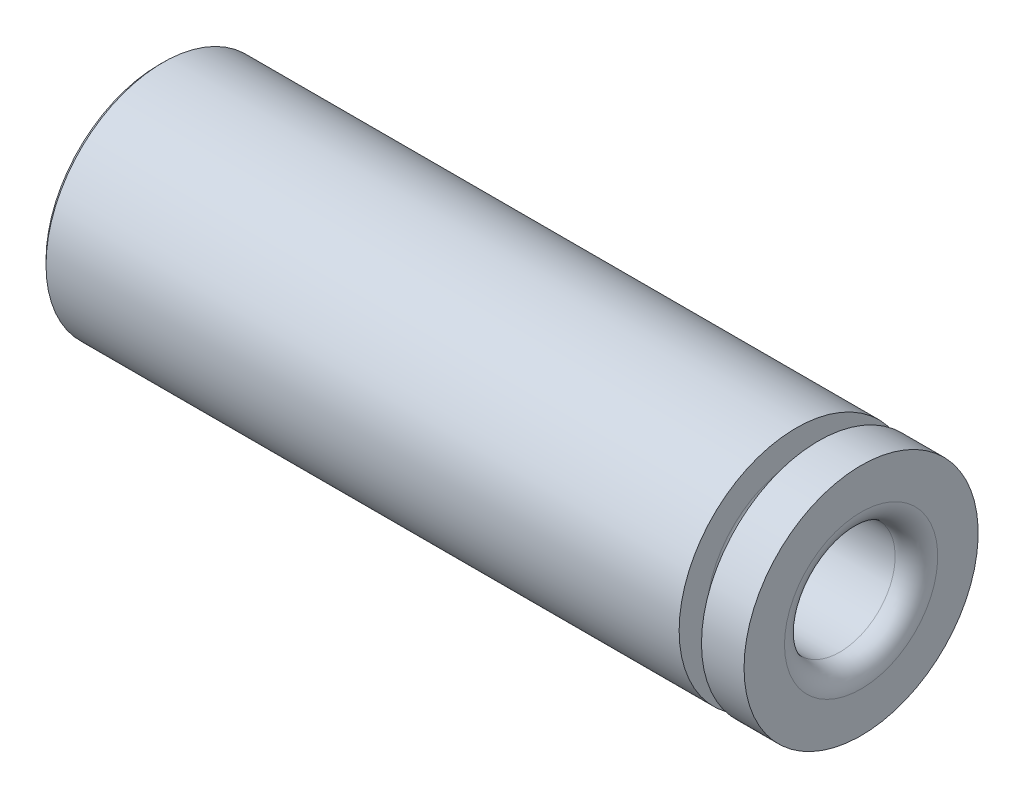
ISO-10303-21;
HEADER;
FILE_DESCRIPTION(('STEP AP214'),'2;1');
FILE_NAME('part.step','',(''),(''),'','','');
FILE_SCHEMA(('AUTOMOTIVE_DESIGN { 1 0 10303 214 1 1 1 1 }'));
ENDSEC;
DATA;
#1=APPLICATION_CONTEXT('core data for automotive mechanical design processes');
#2=APPLICATION_PROTOCOL_DEFINITION('international standard','automotive_design',2000,#1);
#3=PRODUCT_CONTEXT('',#1,'mechanical');
#4=PRODUCT('Part','Part','',(#3));
#5=PRODUCT_RELATED_PRODUCT_CATEGORY('part','',(#4));
#6=PRODUCT_DEFINITION_FORMATION('','',#4);
#7=PRODUCT_DEFINITION_CONTEXT('part definition',#1,'design');
#8=PRODUCT_DEFINITION('design','',#6,#7);
#9=PRODUCT_DEFINITION_SHAPE('','',#8);
#10=(LENGTH_UNIT() NAMED_UNIT(*) SI_UNIT(.MILLI.,.METRE.));
#11=(NAMED_UNIT(*) PLANE_ANGLE_UNIT() SI_UNIT($,.RADIAN.));
#12=(NAMED_UNIT(*) SI_UNIT($,.STERADIAN.) SOLID_ANGLE_UNIT());
#13=UNCERTAINTY_MEASURE_WITH_UNIT(LENGTH_MEASURE(1.E-05),#10,'distance_accuracy_value','');
#14=(GEOMETRIC_REPRESENTATION_CONTEXT(3) GLOBAL_UNCERTAINTY_ASSIGNED_CONTEXT((#13)) GLOBAL_UNIT_ASSIGNED_CONTEXT((#10,
#11,#12)) REPRESENTATION_CONTEXT('',''));
#15=CARTESIAN_POINT('',(0.,0.,0.));
#16=DIRECTION('',(0.,0.,1.));
#17=DIRECTION('',(1.,0.,0.));
#18=AXIS2_PLACEMENT_3D('',#15,#16,#17);
#19=CARTESIAN_POINT('',(0.,0.,0.));
#20=DIRECTION('',(-1.,0.,0.));
#21=DIRECTION('',(0.,0.,1.));
#22=AXIS2_PLACEMENT_3D('',#19,#20,#21);
#23=CYLINDRICAL_SURFACE('',#22,5.5);
#24=CARTESIAN_POINT('',(0.199999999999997,0.,0.));
#25=DIRECTION('',(1.,0.,0.));
#26=DIRECTION('',(0.,0.,-1.));
#27=AXIS2_PLACEMENT_3D('',#24,#25,#26);
#28=CIRCLE('',#27,5.5);
#29=CARTESIAN_POINT('',(0.199999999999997,0.,-5.5));
#30=VERTEX_POINT('',#29);
#31=EDGE_CURVE('E59',#30,#30,#28,.T.);
#32=ORIENTED_EDGE('',*,*,#31,.T.);
#33=EDGE_LOOP('',(#32));
#34=FACE_BOUND('',#33,.T.);
#35=CARTESIAN_POINT('',(29.95,0.,0.));
#36=DIRECTION('',(-1.,0.,0.));
#37=DIRECTION('',(0.,0.,1.));
#38=AXIS2_PLACEMENT_3D('',#35,#36,#37);
#39=CIRCLE('',#38,5.5);
#40=CARTESIAN_POINT('',(29.95,0.,5.5));
#41=VERTEX_POINT('',#40);
#42=EDGE_CURVE('E86',#41,#41,#39,.T.);
#43=ORIENTED_EDGE('',*,*,#42,.T.);
#44=EDGE_LOOP('',(#43));
#45=FACE_BOUND('',#44,.T.);
#46=ADVANCED_FACE('F33',(#34,#45),#23,.T.);
#47=CARTESIAN_POINT('',(0.,5.5,0.));
#48=DIRECTION('',(1.,0.,0.));
#49=DIRECTION('',(0.,0.,-1.));
#50=AXIS2_PLACEMENT_3D('',#47,#48,#49);
#51=PLANE('',#50);
#52=CARTESIAN_POINT('',(0.,0.,0.));
#53=DIRECTION('',(1.,0.,0.));
#54=DIRECTION('',(0.,0.,-1.));
#55=AXIS2_PLACEMENT_3D('',#52,#53,#54);
#56=CIRCLE('',#55,4.65000000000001);
#57=CARTESIAN_POINT('',(0.,0.,-4.65000000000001));
#58=VERTEX_POINT('',#57);
#59=EDGE_CURVE('E53',#58,#58,#56,.T.);
#60=ORIENTED_EDGE('',*,*,#59,.T.);
#61=EDGE_LOOP('',(#60));
#62=FACE_BOUND('',#61,.T.);
#63=CARTESIAN_POINT('',(0.,0.,0.));
#64=DIRECTION('',(1.,0.,0.));
#65=DIRECTION('',(0.,0.,-1.));
#66=AXIS2_PLACEMENT_3D('',#63,#64,#65);
#67=CIRCLE('',#66,5.3);
#68=CARTESIAN_POINT('',(0.,0.,-5.3));
#69=VERTEX_POINT('',#68);
#70=EDGE_CURVE('E62',#69,#69,#67,.F.);
#71=ORIENTED_EDGE('',*,*,#70,.T.);
#72=EDGE_LOOP('',(#71));
#73=FACE_BOUND('',#72,.T.);
#74=ADVANCED_FACE('F107',(#62,#73),#51,.F.);
#75=CARTESIAN_POINT('',(0.,0.,0.));
#76=DIRECTION('',(-1.,0.,0.));
#77=DIRECTION('',(0.,0.,1.));
#78=AXIS2_PLACEMENT_3D('',#75,#76,#77);
#79=CYLINDRICAL_SURFACE('',#78,4.35);
#80=CARTESIAN_POINT('',(0.30000000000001,0.,0.));
#81=DIRECTION('',(1.,0.,0.));
#82=DIRECTION('',(0.,0.,-1.));
#83=AXIS2_PLACEMENT_3D('',#80,#81,#82);
#84=CIRCLE('',#83,4.35);
#85=CARTESIAN_POINT('',(0.30000000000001,0.,-4.35));
#86=VERTEX_POINT('',#85);
#87=EDGE_CURVE('E56',#86,#86,#84,.F.);
#88=ORIENTED_EDGE('',*,*,#87,.T.);
#89=EDGE_LOOP('',(#88));
#90=FACE_BOUND('',#89,.T.);
#91=CARTESIAN_POINT('',(5.8,0.,0.));
#92=DIRECTION('',(1.,0.,0.));
#93=DIRECTION('',(0.,0.,-1.));
#94=AXIS2_PLACEMENT_3D('',#91,#92,#93);
#95=CIRCLE('',#94,4.35);
#96=CARTESIAN_POINT('',(5.8,0.,-4.35));
#97=VERTEX_POINT('',#96);
#98=EDGE_CURVE('E65',#97,#97,#95,.T.);
#99=ORIENTED_EDGE('',*,*,#98,.T.);
#100=EDGE_LOOP('',(#99));
#101=FACE_BOUND('',#100,.T.);
#102=ADVANCED_FACE('F113',(#90,#101),#79,.F.);
#103=CARTESIAN_POINT('',(6.,4.35,0.));
#104=DIRECTION('',(1.,0.,0.));
#105=DIRECTION('',(0.,0.,-1.));
#106=AXIS2_PLACEMENT_3D('',#103,#104,#105);
#107=PLANE('',#106);
#108=CARTESIAN_POINT('',(6.,0.,0.));
#109=DIRECTION('',(1.,0.,0.));
#110=DIRECTION('',(0.,0.,-1.));
#111=AXIS2_PLACEMENT_3D('',#108,#109,#110);
#112=CIRCLE('',#111,4.15);
#113=CARTESIAN_POINT('',(6.,0.,-4.15));
#114=VERTEX_POINT('',#113);
#115=EDGE_CURVE('E68',#114,#114,#112,.F.);
#116=ORIENTED_EDGE('',*,*,#115,.T.);
#117=EDGE_LOOP('',(#116));
#118=FACE_BOUND('',#117,.T.);
#119=CARTESIAN_POINT('',(6.,0.,0.));
#120=DIRECTION('',(-1.,0.,0.));
#121=DIRECTION('',(0.,0.,1.));
#122=AXIS2_PLACEMENT_3D('',#119,#120,#121);
#123=CIRCLE('',#122,2.6);
#124=CARTESIAN_POINT('',(6.,0.,2.6));
#125=VERTEX_POINT('',#124);
#126=EDGE_CURVE('E77',#125,#125,#123,.T.);
#127=ORIENTED_EDGE('',*,*,#126,.F.);
#128=EDGE_LOOP('',(#127));
#129=FACE_BOUND('',#128,.T.);
#130=ADVANCED_FACE('F184',(#118,#129),#107,.F.);
#131=CARTESIAN_POINT('',(0.,0.,0.));
#132=DIRECTION('',(-1.,0.,0.));
#133=DIRECTION('',(0.,0.,1.));
#134=AXIS2_PLACEMENT_3D('',#131,#132,#133);
#135=CYLINDRICAL_SURFACE('',#134,2.6);
#136=CARTESIAN_POINT('',(32.,0.,0.));
#137=DIRECTION('',(-1.,0.,0.));
#138=DIRECTION('',(0.,0.,1.));
#139=AXIS2_PLACEMENT_3D('',#136,#137,#138);
#140=CIRCLE('',#139,2.6);
#141=CARTESIAN_POINT('',(32.,0.,2.6));
#142=VERTEX_POINT('',#141);
#143=EDGE_CURVE('E71',#142,#142,#140,.F.);
#144=ORIENTED_EDGE('',*,*,#143,.T.);
#145=EDGE_LOOP('',(#144));
#146=FACE_BOUND('',#145,.T.);
#147=ORIENTED_EDGE('',*,*,#126,.T.);
#148=EDGE_LOOP('',(#147));
#149=FACE_BOUND('',#148,.T.);
#150=ADVANCED_FACE('F214',(#146,#149),#135,.F.);
#151=CARTESIAN_POINT('',(33.,2.6,0.));
#152=DIRECTION('',(-1.,0.,0.));
#153=DIRECTION('',(0.,0.,1.));
#154=AXIS2_PLACEMENT_3D('',#151,#152,#153);
#155=PLANE('',#154);
#156=CARTESIAN_POINT('',(33.,0.,0.));
#157=DIRECTION('',(-1.,0.,0.));
#158=DIRECTION('',(0.,0.,1.));
#159=AXIS2_PLACEMENT_3D('',#156,#157,#158);
#160=CIRCLE('',#159,3.6);
#161=CARTESIAN_POINT('',(33.,0.,3.6));
#162=VERTEX_POINT('',#161);
#163=EDGE_CURVE('E74',#162,#162,#160,.T.);
#164=ORIENTED_EDGE('',*,*,#163,.T.);
#165=EDGE_LOOP('',(#164));
#166=FACE_BOUND('',#165,.T.);
#167=CARTESIAN_POINT('',(33.,0.,0.));
#168=DIRECTION('',(-1.,0.,0.));
#169=DIRECTION('',(0.,0.,1.));
#170=AXIS2_PLACEMENT_3D('',#167,#168,#169);
#171=CIRCLE('',#170,5.5);
#172=CARTESIAN_POINT('',(33.,0.,5.5));
#173=VERTEX_POINT('',#172);
#174=EDGE_CURVE('E80',#173,#173,#171,.T.);
#175=ORIENTED_EDGE('',*,*,#174,.F.);
#176=EDGE_LOOP('',(#175));
#177=FACE_BOUND('',#176,.T.);
#178=ADVANCED_FACE('F227',(#166,#177),#155,.F.);
#179=CARTESIAN_POINT('',(0.,0.,0.));
#180=DIRECTION('',(-1.,0.,0.));
#181=DIRECTION('',(0.,0.,1.));
#182=AXIS2_PLACEMENT_3D('',#179,#180,#181);
#183=CYLINDRICAL_SURFACE('',#182,5.5);
#184=CARTESIAN_POINT('',(31.,0.,0.));
#185=DIRECTION('',(-1.,0.,0.));
#186=DIRECTION('',(0.,0.,1.));
#187=AXIS2_PLACEMENT_3D('',#184,#185,#186);
#188=CIRCLE('',#187,5.5);
#189=CARTESIAN_POINT('',(31.,0.,5.5));
#190=VERTEX_POINT('',#189);
#191=EDGE_CURVE('E83',#190,#190,#188,.T.);
#192=ORIENTED_EDGE('',*,*,#191,.F.);
#193=EDGE_LOOP('',(#192));
#194=FACE_BOUND('',#193,.T.);
#195=ORIENTED_EDGE('',*,*,#174,.T.);
#196=EDGE_LOOP('',(#195));
#197=FACE_BOUND('',#196,.T.);
#198=ADVANCED_FACE('F167',(#194,#197),#183,.T.);
#199=CARTESIAN_POINT('',(31.,5.5,0.));
#200=DIRECTION('',(1.,0.,0.));
#201=DIRECTION('',(0.,0.,-1.));
#202=AXIS2_PLACEMENT_3D('',#199,#200,#201);
#203=PLANE('',#202);
#204=CARTESIAN_POINT('',(31.,0.,0.));
#205=DIRECTION('',(1.,0.,0.));
#206=DIRECTION('',(0.,0.,-1.));
#207=AXIS2_PLACEMENT_3D('',#204,#205,#206);
#208=CIRCLE('',#207,4.2);
#209=CARTESIAN_POINT('',(31.,0.,-4.2));
#210=VERTEX_POINT('',#209);
#211=EDGE_CURVE('E10',#210,#210,#208,.T.);
#212=ORIENTED_EDGE('',*,*,#211,.T.);
#213=EDGE_LOOP('',(#212));
#214=FACE_BOUND('',#213,.T.);
#215=ORIENTED_EDGE('',*,*,#191,.T.);
#216=EDGE_LOOP('',(#215));
#217=FACE_BOUND('',#216,.T.);
#218=ADVANCED_FACE('F104',(#214,#217),#203,.F.);
#219=CARTESIAN_POINT('',(0.,0.,0.));
#220=DIRECTION('',(-1.,0.,0.));
#221=DIRECTION('',(0.,0.,1.));
#222=AXIS2_PLACEMENT_3D('',#219,#220,#221);
#223=CYLINDRICAL_SURFACE('',#222,4.);
#224=CARTESIAN_POINT('',(30.15,0.,0.));
#225=DIRECTION('',(-1.,0.,0.));
#226=DIRECTION('',(0.,0.,1.));
#227=AXIS2_PLACEMENT_3D('',#224,#225,#226);
#228=CIRCLE('',#227,4.);
#229=CARTESIAN_POINT('',(30.15,0.,4.));
#230=VERTEX_POINT('',#229);
#231=EDGE_CURVE('E40',#230,#230,#228,.F.);
#232=ORIENTED_EDGE('',*,*,#231,.T.);
#233=EDGE_LOOP('',(#232));
#234=FACE_BOUND('',#233,.T.);
#235=CARTESIAN_POINT('',(30.8,0.,0.));
#236=DIRECTION('',(1.,0.,0.));
#237=DIRECTION('',(0.,0.,-1.));
#238=AXIS2_PLACEMENT_3D('',#235,#236,#237);
#239=CIRCLE('',#238,4.);
#240=CARTESIAN_POINT('',(30.8,0.,-4.));
#241=VERTEX_POINT('',#240);
#242=EDGE_CURVE('E44',#241,#241,#239,.F.);
#243=ORIENTED_EDGE('',*,*,#242,.T.);
#244=EDGE_LOOP('',(#243));
#245=FACE_BOUND('',#244,.T.);
#246=ADVANCED_FACE('F94',(#234,#245),#223,.T.);
#247=CARTESIAN_POINT('',(29.95,4.,0.));
#248=DIRECTION('',(-1.,0.,0.));
#249=DIRECTION('',(0.,0.,1.));
#250=AXIS2_PLACEMENT_3D('',#247,#248,#249);
#251=PLANE('',#250);
#252=CARTESIAN_POINT('',(29.95,0.,0.));
#253=DIRECTION('',(-1.,0.,0.));
#254=DIRECTION('',(0.,0.,1.));
#255=AXIS2_PLACEMENT_3D('',#252,#253,#254);
#256=CIRCLE('',#255,4.2);
#257=CARTESIAN_POINT('',(29.95,0.,4.2));
#258=VERTEX_POINT('',#257);
#259=EDGE_CURVE('E48',#258,#258,#256,.T.);
#260=ORIENTED_EDGE('',*,*,#259,.T.);
#261=EDGE_LOOP('',(#260));
#262=FACE_BOUND('',#261,.T.);
#263=ORIENTED_EDGE('',*,*,#42,.F.);
#264=EDGE_LOOP('',(#263));
#265=FACE_BOUND('',#264,.T.);
#266=ADVANCED_FACE('F91',(#262,#265),#251,.F.);
#267=CARTESIAN_POINT('',(32.,0.,0.));
#268=DIRECTION('',(-1.,0.,0.));
#269=DIRECTION('',(0.,0.,1.));
#270=AXIS2_PLACEMENT_3D('',#267,#268,#269);
#271=TOROIDAL_SURFACE('',#270,3.6,1.);
#272=ORIENTED_EDGE('',*,*,#143,.F.);
#273=EDGE_LOOP('',(#272));
#274=FACE_BOUND('',#273,.T.);
#275=ORIENTED_EDGE('',*,*,#163,.F.);
#276=EDGE_LOOP('',(#275));
#277=FACE_BOUND('',#276,.T.);
#278=ADVANCED_FACE('F93',(#274,#277),#271,.T.);
#279=CARTESIAN_POINT('',(5.8,0.,0.));
#280=DIRECTION('',(1.,0.,0.));
#281=DIRECTION('',(0.,0.,-1.));
#282=AXIS2_PLACEMENT_3D('',#279,#280,#281);
#283=TOROIDAL_SURFACE('',#282,4.15,0.2);
#284=ORIENTED_EDGE('',*,*,#98,.F.);
#285=EDGE_LOOP('',(#284));
#286=FACE_BOUND('',#285,.T.);
#287=ORIENTED_EDGE('',*,*,#115,.F.);
#288=EDGE_LOOP('',(#287));
#289=FACE_BOUND('',#288,.T.);
#290=ADVANCED_FACE('F101',(#286,#289),#283,.F.);
#291=CARTESIAN_POINT('',(0.,0.,0.));
#292=DIRECTION('',(1.,0.,0.));
#293=DIRECTION('',(0.,0.,-1.));
#294=AXIS2_PLACEMENT_3D('',#291,#292,#293);
#295=CONICAL_SURFACE('',#294,5.3,0.785398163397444);
#296=ORIENTED_EDGE('',*,*,#31,.F.);
#297=EDGE_LOOP('',(#296));
#298=FACE_BOUND('',#297,.T.);
#299=ORIENTED_EDGE('',*,*,#70,.F.);
#300=EDGE_LOOP('',(#299));
#301=FACE_BOUND('',#300,.T.);
#302=ADVANCED_FACE('F120',(#298,#301),#295,.T.);
#303=CARTESIAN_POINT('',(0.30000000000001,0.,0.));
#304=DIRECTION('',(-1.,0.,0.));
#305=DIRECTION('',(0.,0.,1.));
#306=AXIS2_PLACEMENT_3D('',#303,#304,#305);
#307=CONICAL_SURFACE('',#306,4.35,0.785398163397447);
#308=ORIENTED_EDGE('',*,*,#59,.F.);
#309=EDGE_LOOP('',(#308));
#310=FACE_BOUND('',#309,.T.);
#311=ORIENTED_EDGE('',*,*,#87,.F.);
#312=EDGE_LOOP('',(#311));
#313=FACE_BOUND('',#312,.T.);
#314=ADVANCED_FACE('F124',(#310,#313),#307,.F.);
#315=CARTESIAN_POINT('',(30.15,0.,0.));
#316=DIRECTION('',(-1.,0.,0.));
#317=DIRECTION('',(0.,0.,1.));
#318=AXIS2_PLACEMENT_3D('',#315,#316,#317);
#319=TOROIDAL_SURFACE('',#318,4.2,0.2);
#320=ORIENTED_EDGE('',*,*,#231,.F.);
#321=EDGE_LOOP('',(#320));
#322=FACE_BOUND('',#321,.T.);
#323=ORIENTED_EDGE('',*,*,#259,.F.);
#324=EDGE_LOOP('',(#323));
#325=FACE_BOUND('',#324,.T.);
#326=ADVANCED_FACE('F127',(#322,#325),#319,.F.);
#327=CARTESIAN_POINT('',(30.8,0.,0.));
#328=DIRECTION('',(1.,0.,0.));
#329=DIRECTION('',(0.,0.,-1.));
#330=AXIS2_PLACEMENT_3D('',#327,#328,#329);
#331=TOROIDAL_SURFACE('',#330,4.2,0.2);
#332=ORIENTED_EDGE('',*,*,#211,.F.);
#333=EDGE_LOOP('',(#332));
#334=FACE_BOUND('',#333,.T.);
#335=ORIENTED_EDGE('',*,*,#242,.F.);
#336=EDGE_LOOP('',(#335));
#337=FACE_BOUND('',#336,.T.);
#338=ADVANCED_FACE('F35',(#334,#337),#331,.F.);
#339=CLOSED_SHELL('',(#46,#74,#102,#130,#150,#178,#198,#218,#246,#266,#278,#290,#302,#314,#326,#338));
#340=MANIFOLD_SOLID_BREP('B2',#339);
#341=ADVANCED_BREP_SHAPE_REPRESENTATION('',(#18,#340),#14);
#342=SHAPE_DEFINITION_REPRESENTATION(#9,#341);
ENDSEC;
END-ISO-10303-21;
